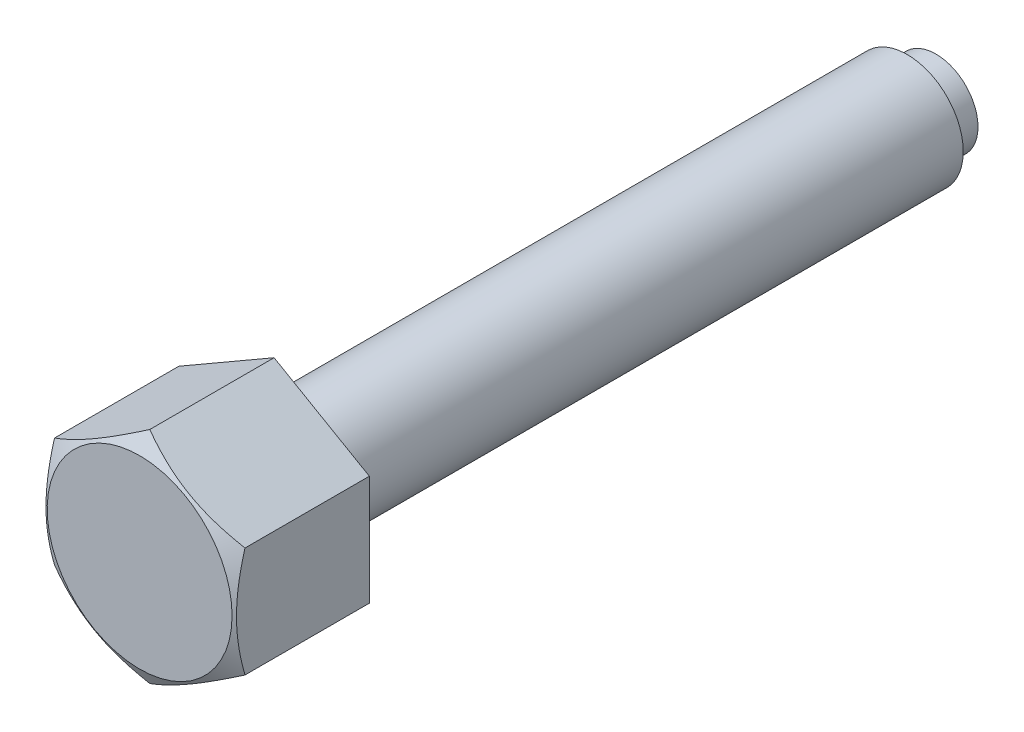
ISO-10303-21;
HEADER;
FILE_DESCRIPTION(('STEP AP214'),'2;1');
FILE_NAME('part.step','',(''),(''),'','','');
FILE_SCHEMA(('AUTOMOTIVE_DESIGN { 1 0 10303 214 1 1 1 1 }'));
ENDSEC;
DATA;
#1=APPLICATION_CONTEXT('core data for automotive mechanical design processes');
#2=APPLICATION_PROTOCOL_DEFINITION('international standard','automotive_design',2000,#1);
#3=PRODUCT_CONTEXT('',#1,'mechanical');
#4=PRODUCT('Part','Part','',(#3));
#5=PRODUCT_RELATED_PRODUCT_CATEGORY('part','',(#4));
#6=PRODUCT_DEFINITION_FORMATION('','',#4);
#7=PRODUCT_DEFINITION_CONTEXT('part definition',#1,'design');
#8=PRODUCT_DEFINITION('design','',#6,#7);
#9=PRODUCT_DEFINITION_SHAPE('','',#8);
#10=(LENGTH_UNIT() NAMED_UNIT(*) SI_UNIT(.MILLI.,.METRE.));
#11=(NAMED_UNIT(*) PLANE_ANGLE_UNIT() SI_UNIT($,.RADIAN.));
#12=(NAMED_UNIT(*) SI_UNIT($,.STERADIAN.) SOLID_ANGLE_UNIT());
#13=UNCERTAINTY_MEASURE_WITH_UNIT(LENGTH_MEASURE(1.E-05),#10,'distance_accuracy_value','');
#14=(GEOMETRIC_REPRESENTATION_CONTEXT(3) GLOBAL_UNCERTAINTY_ASSIGNED_CONTEXT((#13)) GLOBAL_UNIT_ASSIGNED_CONTEXT((#10,
#11,#12)) REPRESENTATION_CONTEXT('',''));
#15=CARTESIAN_POINT('',(0.,0.,0.));
#16=DIRECTION('',(0.,0.,1.));
#17=DIRECTION('',(1.,0.,0.));
#18=AXIS2_PLACEMENT_3D('',#15,#16,#17);
#19=CARTESIAN_POINT('',(0.,9.81495457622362,58.));
#20=DIRECTION('',(-0.5,-0.86602540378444,0.));
#21=DIRECTION('',(0.86602540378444,-0.5,0.));
#22=AXIS2_PLACEMENT_3D('',#19,#20,#21);
#23=PLANE('',#22);
#24=CARTESIAN_POINT('',(8.5002,4.90736181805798,71.0964063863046));
#25=CARTESIAN_POINT('',(8.31336077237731,5.01523349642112,71.1586762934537));
#26=CARTESIAN_POINT('',(8.12582494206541,5.1235073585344,71.2181201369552));
#27=CARTESIAN_POINT('',(7.74923024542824,5.34093440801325,71.3305773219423));
#28=CARTESIAN_POINT('',(7.56017075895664,5.45008795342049,71.3835878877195));
#29=CARTESIAN_POINT('',(6.98996524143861,5.77929626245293,71.5319290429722));
#30=CARTESIAN_POINT('',(6.60656835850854,6.00065055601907,71.6163035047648));
#31=CARTESIAN_POINT('',(6.03282233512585,6.33190297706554,71.7152424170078));
#32=CARTESIAN_POINT('',(5.84418723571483,6.44081150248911,71.7434272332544));
#33=CARTESIAN_POINT('',(5.4660639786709,6.65912106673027,71.7906883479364));
#34=CARTESIAN_POINT('',(5.27657589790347,6.76852206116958,71.8097654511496));
#35=CARTESIAN_POINT('',(4.89727347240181,6.98751241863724,71.8383276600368));
#36=CARTESIAN_POINT('',(4.70745974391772,7.09710142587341,71.8478236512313));
#37=CARTESIAN_POINT('',(4.32765694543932,7.31638067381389,71.8570200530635));
#38=CARTESIAN_POINT('',(4.13766788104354,7.42607091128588,71.8567207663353));
#39=CARTESIAN_POINT('',(3.78247698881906,7.63114046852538,71.8470079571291));
#40=CARTESIAN_POINT('',(3.6172500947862,7.72653426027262,71.838779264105));
#41=CARTESIAN_POINT('',(3.28718328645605,7.91709842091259,71.8150731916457));
#42=CARTESIAN_POINT('',(3.12234339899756,8.01226877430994,71.7995953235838));
#43=CARTESIAN_POINT('',(2.62846189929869,8.29741139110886,71.742653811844));
#44=CARTESIAN_POINT('',(2.30029449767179,8.48687892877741,71.690689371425));
#45=CARTESIAN_POINT('',(1.64047857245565,8.86782383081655,71.5607774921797));
#46=CARTESIAN_POINT('',(1.30891425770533,9.05925257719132,71.4822793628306));
#47=CARTESIAN_POINT('',(0.650730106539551,9.43925537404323,71.30412109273));
#48=CARTESIAN_POINT('',(0.324101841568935,9.62783429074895,71.2045027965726));
#49=CARTESIAN_POINT('',(-0.000199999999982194,9.81507004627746,71.0964063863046));
#50=B_SPLINE_CURVE_WITH_KNOTS('',3,(#24,#25,#26,#27,#28,#29,#30,#31,#32,#33,#34,#35,#36,#37,#38,
#39,#40,#41,#42,#43,#44,#45,#46,#47,#48,#49),.UNSPECIFIED.,.F.,.F.,(4,2,2,2,2,2,2,2,2,2,2,2,4),
(0.,0.673596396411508,1.34748239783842,2.69805431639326,3.35679995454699,4.01548737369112,
4.67342558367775,5.33134346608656,5.9040955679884,6.47688628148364,7.62328361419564,
8.79510569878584,9.96462743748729),.UNSPECIFIED.);
#51=CARTESIAN_POINT('',(8.5,4.90747728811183,71.0964730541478));
#52=VERTEX_POINT('',#51);
#53=CARTESIAN_POINT('',(0.,9.81495457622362,71.0964730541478));
#54=VERTEX_POINT('',#53);
#55=EDGE_CURVE('E30',#52,#54,#50,.T.);
#56=ORIENTED_EDGE('',*,*,#55,.F.);
#57=DIRECTION('',(0.,0.,1.));
#58=VECTOR('',#57,1.);
#59=CARTESIAN_POINT('',(8.5,4.90747728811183,58.));
#60=LINE('',#59,#58);
#61=CARTESIAN_POINT('',(8.5,4.90747728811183,60.));
#62=VERTEX_POINT('',#61);
#63=EDGE_CURVE('E97',#62,#52,#60,.T.);
#64=ORIENTED_EDGE('',*,*,#63,.F.);
#65=DIRECTION('',(0.86602540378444,-0.5,0.));
#66=VECTOR('',#65,1.);
#67=CARTESIAN_POINT('',(8.,5.19615242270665,60.));
#68=LINE('',#67,#66);
#69=CARTESIAN_POINT('',(0.,9.81495457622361,60.));
#70=VERTEX_POINT('',#69);
#71=EDGE_CURVE('E111',#70,#62,#68,.T.);
#72=ORIENTED_EDGE('',*,*,#71,.F.);
#73=DIRECTION('',(0.,0.,1.));
#74=VECTOR('',#73,1.);
#75=CARTESIAN_POINT('',(0.,9.81495457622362,58.));
#76=LINE('',#75,#74);
#77=EDGE_CURVE('E37',#70,#54,#76,.T.);
#78=ORIENTED_EDGE('',*,*,#77,.T.);
#79=EDGE_LOOP('',(#56,#64,#72,#78));
#80=FACE_BOUND('',#79,.T.);
#81=ADVANCED_FACE('F15',(#80),#23,.F.);
#82=CARTESIAN_POINT('',(8.5,4.90747728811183,58.));
#83=DIRECTION('',(-1.,0.,0.));
#84=DIRECTION('',(0.,0.,1.));
#85=AXIS2_PLACEMENT_3D('',#82,#83,#84);
#86=PLANE('',#85);
#87=CARTESIAN_POINT('',(8.5,-13.1444852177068,67.7256715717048));
#88=CARTESIAN_POINT('',(8.5,-12.7735482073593,67.9054577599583));
#89=CARTESIAN_POINT('',(8.5,-12.4017556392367,68.0835091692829));
#90=CARTESIAN_POINT('',(8.5,-11.6560042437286,68.4351659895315));
#91=CARTESIAN_POINT('',(8.5,-11.2820450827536,68.60877069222));
#92=CARTESIAN_POINT('',(8.5,-10.5295605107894,68.9514391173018));
#93=CARTESIAN_POINT('',(8.5,-10.1510212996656,69.1204726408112));
#94=CARTESIAN_POINT('',(8.5,-9.39091897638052,69.451571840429));
#95=CARTESIAN_POINT('',(8.5,-9.00935600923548,69.6136378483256));
#96=CARTESIAN_POINT('',(8.5,-8.23042824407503,69.9339663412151));
#97=CARTESIAN_POINT('',(8.5,-7.83294612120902,70.0919451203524));
#98=CARTESIAN_POINT('',(8.5,-7.0333186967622,70.3958549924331));
#99=CARTESIAN_POINT('',(8.5,-6.63117287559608,70.5417847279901));
#100=CARTESIAN_POINT('',(8.5,-5.82233833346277,70.8177375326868));
#101=CARTESIAN_POINT('',(8.5,-5.41566083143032,70.9477931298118));
#102=CARTESIAN_POINT('',(8.5,-4.59648722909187,71.1878013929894));
#103=CARTESIAN_POINT('',(8.5,-4.18399301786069,71.2977604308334));
#104=CARTESIAN_POINT('',(8.5,-3.35516554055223,71.4916836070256));
#105=CARTESIAN_POINT('',(8.5,-2.93886583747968,71.575787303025));
#106=CARTESIAN_POINT('',(8.5,-2.31065557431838,71.6788915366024));
#107=CARTESIAN_POINT('',(8.5,-2.10060965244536,71.709419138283));
#108=CARTESIAN_POINT('',(8.5,-1.67948660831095,71.7621909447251));
#109=CARTESIAN_POINT('',(8.5,-1.46840958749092,71.7844359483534));
#110=CARTESIAN_POINT('',(8.5,-1.04824802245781,71.8199223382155));
#111=CARTESIAN_POINT('',(8.5,-0.83917304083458,71.8332765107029));
#112=CARTESIAN_POINT('',(8.5,-0.420645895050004,71.8511341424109));
#113=CARTESIAN_POINT('',(8.5,-0.211193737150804,71.8556377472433));
#114=CARTESIAN_POINT('',(8.5,0.207713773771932,71.8556869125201));
#115=CARTESIAN_POINT('',(8.5,0.417169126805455,71.8512324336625));
#116=CARTESIAN_POINT('',(8.5,0.835707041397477,71.8334736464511));
#117=CARTESIAN_POINT('',(8.5,1.04478958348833,71.8201688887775));
#118=CARTESIAN_POINT('',(8.5,1.54842530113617,71.7777413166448));
#119=CARTESIAN_POINT('',(8.5,1.84262681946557,71.7443556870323));
#120=CARTESIAN_POINT('',(8.5,2.42880766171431,71.6618915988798));
#121=CARTESIAN_POINT('',(8.5,2.7207866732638,71.6128109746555));
#122=CARTESIAN_POINT('',(8.5,3.59307794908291,71.4446324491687));
#123=CARTESIAN_POINT('',(8.5,4.16941089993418,71.3046296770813));
#124=CARTESIAN_POINT('',(8.5,5.03112954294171,71.0623378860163));
#125=CARTESIAN_POINT('',(8.5,5.3209971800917,70.9750764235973));
#126=CARTESIAN_POINT('',(8.5,5.8979162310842,70.7916109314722));
#127=CARTESIAN_POINT('',(8.5,6.18496762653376,70.6954068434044));
#128=CARTESIAN_POINT('',(8.5,6.75634679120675,70.4955896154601));
#129=CARTESIAN_POINT('',(8.5,7.04067545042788,70.3919789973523));
#130=CARTESIAN_POINT('',(8.5,7.6069852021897,70.1785557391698));
#131=CARTESIAN_POINT('',(8.5,7.88896632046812,70.0687431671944));
#132=CARTESIAN_POINT('',(8.5,8.54720008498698,69.8053973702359));
#133=CARTESIAN_POINT('',(8.5,8.92261940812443,69.6497852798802));
#134=CARTESIAN_POINT('',(8.5,9.67032637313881,69.3311898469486));
#135=CARTESIAN_POINT('',(8.5,10.0426138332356,69.168206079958));
#136=CARTESIAN_POINT('',(8.5,10.7846309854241,68.8363238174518));
#137=CARTESIAN_POINT('',(8.5,11.1543601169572,68.667424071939));
#138=CARTESIAN_POINT('',(8.5,11.8916026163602,68.3248863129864));
#139=CARTESIAN_POINT('',(8.5,12.2591160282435,68.1512483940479));
#140=CARTESIAN_POINT('',(8.5,12.9926756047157,67.7999257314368));
#141=CARTESIAN_POINT('',(8.5,13.3587198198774,67.6222369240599));
#142=CARTESIAN_POINT('',(8.5,14.0892432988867,67.2636680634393));
#143=CARTESIAN_POINT('',(8.5,14.4537225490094,67.0827879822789));
#144=CARTESIAN_POINT('',(8.5,15.5450894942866,66.5362453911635));
#145=CARTESIAN_POINT('',(8.5,16.2700001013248,66.1666352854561));
#146=CARTESIAN_POINT('',(8.5,17.6565146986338,65.4506840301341));
#147=CARTESIAN_POINT('',(8.5,18.3184225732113,65.1049287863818));
#148=CARTESIAN_POINT('',(8.5,19.6397705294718,64.4086843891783));
#149=CARTESIAN_POINT('',(8.5,20.2992105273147,64.0581950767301));
#150=CARTESIAN_POINT('',(8.5,21.6145701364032,63.3544543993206));
#151=CARTESIAN_POINT('',(8.5,22.2704944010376,63.0012117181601));
#152=CARTESIAN_POINT('',(8.5,23.5807608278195,62.2918862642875));
#153=CARTESIAN_POINT('',(8.5,24.2351030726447,61.9358036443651));
#154=CARTESIAN_POINT('',(8.5,24.8888609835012,61.5786585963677));
#155=B_SPLINE_CURVE_WITH_KNOTS('',3,(#87,#88,#89,#90,#91,#92,#93,#94,#95,#96,#97,#98,#99,#100,
#101,#102,#103,#104,#105,#106,#107,#108,#109,#110,#111,#112,#113,#114,#115,#116,#117,#118,#119,
#120,#121,#122,#123,#124,#125,#126,#127,#128,#129,#130,#131,#132,#133,#134,#135,#136,#137,#138,
#139,#140,#141,#142,#143,#144,#145,#146,#147,#148,#149,#150,#151,#152,#153,#154),.UNSPECIFIED.,
.F.,.F.,(4,2,2,2,2,2,2,2,2,2,2,2,2,2,2,2,2,2,2,2,2,2,2,2,2,2,2,2,2,2,2,2,2,4),(0.,
1.23664620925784,2.47348817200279,3.71712738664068,4.96070731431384,6.24373307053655,
7.52690316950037,8.80739811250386,10.0874863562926,11.3605386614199,11.9971592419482,
12.633718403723,13.262040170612,13.8903516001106,14.5186657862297,15.1470118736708,
16.0347786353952,16.9226679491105,18.6994472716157,19.6075251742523,20.5156090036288,
21.4233851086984,22.3311512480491,23.5502231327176,24.769365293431,25.9887666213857,
27.208143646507,28.4288029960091,29.649473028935,32.0905009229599,34.3307970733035,
36.571168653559,38.8061451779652,41.0410022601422),.UNSPECIFIED.);
#156=CARTESIAN_POINT('',(8.5,-4.90747728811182,71.0964730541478));
#157=VERTEX_POINT('',#156);
#158=EDGE_CURVE('E157',#157,#52,#155,.T.);
#159=ORIENTED_EDGE('',*,*,#158,.F.);
#160=DIRECTION('',(0.,0.,1.));
#161=VECTOR('',#160,1.);
#162=CARTESIAN_POINT('',(8.5,-4.90747728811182,58.));
#163=LINE('',#162,#161);
#164=CARTESIAN_POINT('',(8.5,-4.90747728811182,60.));
#165=VERTEX_POINT('',#164);
#166=EDGE_CURVE('E94',#165,#157,#163,.T.);
#167=ORIENTED_EDGE('',*,*,#166,.F.);
#168=DIRECTION('',(0.,-1.,0.));
#169=VECTOR('',#168,1.);
#170=CARTESIAN_POINT('',(8.5,0.,60.));
#171=LINE('',#170,#169);
#172=EDGE_CURVE('E108',#62,#165,#171,.T.);
#173=ORIENTED_EDGE('',*,*,#172,.F.);
#174=ORIENTED_EDGE('',*,*,#63,.T.);
#175=EDGE_LOOP('',(#159,#167,#173,#174));
#176=FACE_BOUND('',#175,.T.);
#177=ADVANCED_FACE('F137',(#176),#86,.F.);
#178=CARTESIAN_POINT('',(0.,-9.81495457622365,58.));
#179=DIRECTION('',(0.5,-0.866025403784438,0.));
#180=DIRECTION('',(0.866025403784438,0.5,0.));
#181=AXIS2_PLACEMENT_3D('',#178,#179,#180);
#182=PLANE('',#181);
#183=ORIENTED_EDGE('',*,*,#166,.T.);
#184=CARTESIAN_POINT('',(8.5002,-4.90736181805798,71.0964063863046));
#185=CARTESIAN_POINT('',(8.31336077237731,-5.01523349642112,71.1586762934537));
#186=CARTESIAN_POINT('',(8.1258249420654,-5.1235073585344,71.2181201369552));
#187=CARTESIAN_POINT('',(7.74923024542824,-5.34093440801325,71.3305773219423));
#188=CARTESIAN_POINT('',(7.56017075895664,-5.45008795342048,71.3835878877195));
#189=CARTESIAN_POINT('',(6.98996524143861,-5.77929626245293,71.5319290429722));
#190=CARTESIAN_POINT('',(6.60656835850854,-6.00065055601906,71.6163035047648));
#191=CARTESIAN_POINT('',(6.03282233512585,-6.33190297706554,71.7152424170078));
#192=CARTESIAN_POINT('',(5.84418723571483,-6.4408115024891,71.7434272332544));
#193=CARTESIAN_POINT('',(5.4660639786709,-6.65912106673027,71.7906883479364));
#194=CARTESIAN_POINT('',(5.27657589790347,-6.76852206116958,71.8097654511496));
#195=CARTESIAN_POINT('',(4.89727347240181,-6.98751241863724,71.8383276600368));
#196=CARTESIAN_POINT('',(4.70745974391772,-7.09710142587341,71.8478236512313));
#197=CARTESIAN_POINT('',(4.32765694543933,-7.31638067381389,71.8570200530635));
#198=CARTESIAN_POINT('',(4.13766788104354,-7.42607091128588,71.8567207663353));
#199=CARTESIAN_POINT('',(3.78247698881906,-7.63114046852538,71.8470079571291));
#200=CARTESIAN_POINT('',(3.6172500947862,-7.72653426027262,71.838779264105));
#201=CARTESIAN_POINT('',(3.28718328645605,-7.9170984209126,71.8150731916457));
#202=CARTESIAN_POINT('',(3.12234339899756,-8.01226877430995,71.7995953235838));
#203=CARTESIAN_POINT('',(2.62846189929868,-8.29741139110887,71.7426538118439));
#204=CARTESIAN_POINT('',(2.30029449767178,-8.48687892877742,71.690689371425));
#205=CARTESIAN_POINT('',(1.64047857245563,-8.86782383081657,71.5607774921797));
#206=CARTESIAN_POINT('',(1.30891425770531,-9.05925257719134,71.4822793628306));
#207=CARTESIAN_POINT('',(0.650730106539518,-9.43925537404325,71.30412109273));
#208=CARTESIAN_POINT('',(0.324101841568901,-9.62783429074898,71.2045027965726));
#209=CARTESIAN_POINT('',(-0.000200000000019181,-9.81507004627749,71.0964063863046));
#210=B_SPLINE_CURVE_WITH_KNOTS('',3,(#184,#185,#186,#187,#188,#189,#190,#191,#192,#193,#194,
#195,#196,#197,#198,#199,#200,#201,#202,#203,#204,#205,#206,#207,#208,#209),.UNSPECIFIED.,.F.,
.F.,(4,2,2,2,2,2,2,2,2,2,2,2,4),(0.,0.673596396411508,1.34748239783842,2.69805431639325,
3.35679995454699,4.01548737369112,4.67342558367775,5.33134346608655,5.9040955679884,
6.47688628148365,7.62328361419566,8.79510569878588,9.96462743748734),.UNSPECIFIED.);
#211=CARTESIAN_POINT('',(0.,-9.81495457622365,71.0964730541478));
#212=VERTEX_POINT('',#211);
#213=EDGE_CURVE('E163',#157,#212,#210,.T.);
#214=ORIENTED_EDGE('',*,*,#213,.T.);
#215=DIRECTION('',(0.,0.,1.));
#216=VECTOR('',#215,1.);
#217=CARTESIAN_POINT('',(0.,-9.81495457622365,58.));
#218=LINE('',#217,#216);
#219=CARTESIAN_POINT('',(0.,-9.81495457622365,60.));
#220=VERTEX_POINT('',#219);
#221=EDGE_CURVE('E87',#220,#212,#218,.T.);
#222=ORIENTED_EDGE('',*,*,#221,.F.);
#223=DIRECTION('',(0.866025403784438,0.5,0.));
#224=VECTOR('',#223,1.);
#225=CARTESIAN_POINT('',(8.,-5.19615242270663,60.));
#226=LINE('',#225,#224);
#227=EDGE_CURVE('E106',#220,#165,#226,.T.);
#228=ORIENTED_EDGE('',*,*,#227,.T.);
#229=EDGE_LOOP('',(#183,#214,#222,#228));
#230=FACE_BOUND('',#229,.T.);
#231=ADVANCED_FACE('F143',(#230),#182,.T.);
#232=CARTESIAN_POINT('',(0.,-9.81495457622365,58.));
#233=DIRECTION('',(0.5,0.866025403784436,0.));
#234=DIRECTION('',(-0.866025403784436,0.5,0.));
#235=AXIS2_PLACEMENT_3D('',#232,#233,#234);
#236=PLANE('',#235);
#237=CARTESIAN_POINT('',(-8.5002,-4.90736181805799,71.0964063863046));
#238=CARTESIAN_POINT('',(-8.31336077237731,-5.01523349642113,71.1586762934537));
#239=CARTESIAN_POINT('',(-8.12582494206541,-5.12350735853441,71.2181201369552));
#240=CARTESIAN_POINT('',(-7.74923024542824,-5.34093440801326,71.3305773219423));
#241=CARTESIAN_POINT('',(-7.56017075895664,-5.45008795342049,71.3835878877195));
#242=CARTESIAN_POINT('',(-6.98996524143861,-5.77929626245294,71.5319290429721));
#243=CARTESIAN_POINT('',(-6.60656835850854,-6.00065055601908,71.6163035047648));
#244=CARTESIAN_POINT('',(-6.03282233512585,-6.33190297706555,71.7152424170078));
#245=CARTESIAN_POINT('',(-5.84418723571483,-6.44081150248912,71.7434272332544));
#246=CARTESIAN_POINT('',(-5.4660639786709,-6.65912106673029,71.7906883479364));
#247=CARTESIAN_POINT('',(-5.27657589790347,-6.76852206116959,71.8097654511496));
#248=CARTESIAN_POINT('',(-4.89727347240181,-6.98751241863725,71.8383276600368));
#249=CARTESIAN_POINT('',(-4.70745974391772,-7.09710142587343,71.8478236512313));
#250=CARTESIAN_POINT('',(-4.32765694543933,-7.3163806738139,71.8570200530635));
#251=CARTESIAN_POINT('',(-4.13766788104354,-7.4260709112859,71.8567207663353));
#252=CARTESIAN_POINT('',(-3.78247698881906,-7.6311404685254,71.8470079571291));
#253=CARTESIAN_POINT('',(-3.61725009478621,-7.72653426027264,71.838779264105));
#254=CARTESIAN_POINT('',(-3.28718328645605,-7.91709842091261,71.8150731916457));
#255=CARTESIAN_POINT('',(-3.12234339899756,-8.01226877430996,71.7995953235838));
#256=CARTESIAN_POINT('',(-2.6284618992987,-8.29741139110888,71.7426538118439));
#257=CARTESIAN_POINT('',(-2.3002944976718,-8.48687892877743,71.690689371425));
#258=CARTESIAN_POINT('',(-1.64047857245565,-8.86782383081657,71.5607774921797));
#259=CARTESIAN_POINT('',(-1.30891425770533,-9.05925257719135,71.4822793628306));
#260=CARTESIAN_POINT('',(-0.650730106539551,-9.43925537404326,71.30412109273));
#261=CARTESIAN_POINT('',(-0.324101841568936,-9.62783429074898,71.2045027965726));
#262=CARTESIAN_POINT('',(0.000199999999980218,-9.81507004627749,71.0964063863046));
#263=B_SPLINE_CURVE_WITH_KNOTS('',3,(#237,#238,#239,#240,#241,#242,#243,#244,#245,#246,#247,
#248,#249,#250,#251,#252,#253,#254,#255,#256,#257,#258,#259,#260,#261,#262),.UNSPECIFIED.,.F.,
.F.,(4,2,2,2,2,2,2,2,2,2,2,2,4),(0.,0.673596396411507,1.34748239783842,2.69805431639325,
3.35679995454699,4.01548737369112,4.67342558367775,5.33134346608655,5.90409556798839,
6.47688628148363,7.62328361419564,8.79510569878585,9.96462743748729),.UNSPECIFIED.);
#264=CARTESIAN_POINT('',(-8.5,-4.90747728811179,71.0964730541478));
#265=VERTEX_POINT('',#264);
#266=EDGE_CURVE('E81',#265,#212,#263,.T.);
#267=ORIENTED_EDGE('',*,*,#266,.F.);
#268=DIRECTION('',(0.,0.,1.));
#269=VECTOR('',#268,1.);
#270=CARTESIAN_POINT('',(-8.5,-4.90747728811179,58.));
#271=LINE('',#270,#269);
#272=CARTESIAN_POINT('',(-8.5,-4.90747728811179,60.));
#273=VERTEX_POINT('',#272);
#274=EDGE_CURVE('E80',#273,#265,#271,.T.);
#275=ORIENTED_EDGE('',*,*,#274,.F.);
#276=DIRECTION('',(-0.866025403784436,0.5,0.));
#277=VECTOR('',#276,1.);
#278=CARTESIAN_POINT('',(-0.500000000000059,-9.52627944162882,60.));
#279=LINE('',#278,#277);
#280=EDGE_CURVE('E103',#220,#273,#279,.T.);
#281=ORIENTED_EDGE('',*,*,#280,.F.);
#282=ORIENTED_EDGE('',*,*,#221,.T.);
#283=EDGE_LOOP('',(#267,#275,#281,#282));
#284=FACE_BOUND('',#283,.T.);
#285=ADVANCED_FACE('F239',(#284),#236,.F.);
#286=CARTESIAN_POINT('',(-8.5,4.90747728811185,58.));
#287=DIRECTION('',(-1.,0.,0.));
#288=DIRECTION('',(0.,-1.,0.));
#289=AXIS2_PLACEMENT_3D('',#286,#287,#288);
#290=PLANE('',#289);
#291=ORIENTED_EDGE('',*,*,#274,.T.);
#292=CARTESIAN_POINT('',(-8.5,-13.1444852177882,67.7256715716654));
#293=CARTESIAN_POINT('',(-8.5,-12.773548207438,67.9054577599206));
#294=CARTESIAN_POINT('',(-8.5,-12.4017556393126,68.0835091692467));
#295=CARTESIAN_POINT('',(-8.5,-11.656004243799,68.4351659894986));
#296=CARTESIAN_POINT('',(-8.5,-11.2820450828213,68.6087706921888));
#297=CARTESIAN_POINT('',(-8.5,-10.5295605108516,68.9514391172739));
#298=CARTESIAN_POINT('',(-8.5,-10.1510212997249,69.120472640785));
#299=CARTESIAN_POINT('',(-8.5,-9.3909189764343,69.451571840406));
#300=CARTESIAN_POINT('',(-8.5,-9.00935600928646,69.6136378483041));
#301=CARTESIAN_POINT('',(-8.5,-8.23042824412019,69.9339663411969));
#302=CARTESIAN_POINT('',(-8.5,-7.83294612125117,70.091945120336));
#303=CARTESIAN_POINT('',(-8.5,-7.03331869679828,70.3958549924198));
#304=CARTESIAN_POINT('',(-8.5,-6.63117287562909,70.5417847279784));
#305=CARTESIAN_POINT('',(-8.5,-5.82233833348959,70.8177375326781));
#306=CARTESIAN_POINT('',(-8.5,-5.41566083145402,70.9477931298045));
#307=CARTESIAN_POINT('',(-8.5,-4.59648722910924,71.1878013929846));
#308=CARTESIAN_POINT('',(-8.5,-4.18399301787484,71.2977604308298));
#309=CARTESIAN_POINT('',(-8.5,-3.35516554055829,71.4916836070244));
#310=CARTESIAN_POINT('',(-8.5,-2.93886583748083,71.5757873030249));
#311=CARTESIAN_POINT('',(-8.5,-2.31065557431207,71.6788915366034));
#312=CARTESIAN_POINT('',(-8.5,-2.10060965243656,71.7094191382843));
#313=CARTESIAN_POINT('',(-8.5,-1.67948660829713,71.7621909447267));
#314=CARTESIAN_POINT('',(-8.5,-1.46840958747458,71.784435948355));
#315=CARTESIAN_POINT('',(-8.5,-1.04824802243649,71.819922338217));
#316=CARTESIAN_POINT('',(-8.5,-0.839173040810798,71.8332765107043));
#317=CARTESIAN_POINT('',(-8.5,-0.4206458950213,71.8511341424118));
#318=CARTESIAN_POINT('',(-8.5,-0.211193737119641,71.8556377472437));
#319=CARTESIAN_POINT('',(-8.5,0.207713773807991,71.8556869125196));
#320=CARTESIAN_POINT('',(-8.5,0.417169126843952,71.8512324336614));
#321=CARTESIAN_POINT('',(-8.5,0.835707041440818,71.8334736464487));
#322=CARTESIAN_POINT('',(-8.5,1.04478958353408,71.8201688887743));
#323=CARTESIAN_POINT('',(-8.5,1.5484253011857,71.7777413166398));
#324=CARTESIAN_POINT('',(-8.5,1.84262681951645,71.7443556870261));
#325=CARTESIAN_POINT('',(-8.5,2.42880766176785,71.6618915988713));
#326=CARTESIAN_POINT('',(-8.5,2.72078667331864,71.6128109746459));
#327=CARTESIAN_POINT('',(-8.5,3.5930779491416,71.4446324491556));
#328=CARTESIAN_POINT('',(-8.5,4.16941089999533,71.3046296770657));
#329=CARTESIAN_POINT('',(-8.5,5.03112954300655,71.0623378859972));
#330=CARTESIAN_POINT('',(-8.5,5.3209971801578,70.975076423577));
#331=CARTESIAN_POINT('',(-8.5,5.89791623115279,70.7916109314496));
#332=CARTESIAN_POINT('',(-8.5,6.18496762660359,70.6954068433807));
#333=CARTESIAN_POINT('',(-8.5,6.75634679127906,70.4955896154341));
#334=CARTESIAN_POINT('',(-8.5,7.04067545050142,70.3919789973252));
#335=CARTESIAN_POINT('',(-8.5,7.60698520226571,70.1785557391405));
#336=CARTESIAN_POINT('',(-8.5,7.88896632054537,70.0687431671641));
#337=CARTESIAN_POINT('',(-8.5,8.54720008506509,69.8053973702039));
#338=CARTESIAN_POINT('',(-8.5,8.9226194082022,69.6497852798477));
#339=CARTESIAN_POINT('',(-8.5,9.67032637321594,69.3311898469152));
#340=CARTESIAN_POINT('',(-8.5,10.0426138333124,69.1682060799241));
#341=CARTESIAN_POINT('',(-8.5,10.7846309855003,68.8363238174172));
#342=CARTESIAN_POINT('',(-8.5,11.1543601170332,68.6674240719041));
#343=CARTESIAN_POINT('',(-8.5,11.8916026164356,68.3248863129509));
#344=CARTESIAN_POINT('',(-8.5,12.2591160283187,68.1512483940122));
#345=CARTESIAN_POINT('',(-8.5,12.9926756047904,67.7999257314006));
#346=CARTESIAN_POINT('',(-8.5,13.3587198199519,67.6222369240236));
#347=CARTESIAN_POINT('',(-8.5,14.0892432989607,67.2636680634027));
#348=CARTESIAN_POINT('',(-8.5,14.4537225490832,67.0827879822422));
#349=CARTESIAN_POINT('',(-8.5,15.5450894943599,66.5362453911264));
#350=CARTESIAN_POINT('',(-8.5,16.2700001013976,66.1666352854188));
#351=CARTESIAN_POINT('',(-8.5,17.6565146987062,65.4506840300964));
#352=CARTESIAN_POINT('',(-8.5,18.3184225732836,65.1049287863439));
#353=CARTESIAN_POINT('',(-8.5,19.639770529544,64.40868438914));
#354=CARTESIAN_POINT('',(-8.5,20.2992105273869,64.0581950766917));
#355=CARTESIAN_POINT('',(-8.5,21.6145701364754,63.3544543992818));
#356=CARTESIAN_POINT('',(-8.5,22.2704944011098,63.0012117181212));
#357=CARTESIAN_POINT('',(-8.5,23.5807608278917,62.2918862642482));
#358=CARTESIAN_POINT('',(-8.5,24.2351030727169,61.9358036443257));
#359=CARTESIAN_POINT('',(-8.5,24.8888609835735,61.5786585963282));
#360=B_SPLINE_CURVE_WITH_KNOTS('',3,(#292,#293,#294,#295,#296,#297,#298,#299,#300,#301,#302,
#303,#304,#305,#306,#307,#308,#309,#310,#311,#312,#313,#314,#315,#316,#317,#318,#319,#320,#321,
#322,#323,#324,#325,#326,#327,#328,#329,#330,#331,#332,#333,#334,#335,#336,#337,#338,#339,#340,
#341,#342,#343,#344,#345,#346,#347,#348,#349,#350,#351,#352,#353,#354,#355,#356,#357,#358,#359),
.UNSPECIFIED.,.F.,.F.,(4,2,2,2,2,2,2,2,2,2,2,2,2,2,2,2,2,2,2,2,2,2,2,2,2,2,2,2,2,2,2,2,2,4),(0.,
1.23664620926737,2.47348817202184,3.71712738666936,4.96070731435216,6.24373307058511,
7.52690316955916,8.80739811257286,10.0874863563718,11.3605386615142,11.99715924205,
12.6337184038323,13.2620401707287,13.8903516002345,14.5186657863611,15.1470118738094,
16.0347786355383,16.9226679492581,18.6994472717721,19.6075251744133,20.5156090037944,
21.4233851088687,22.331151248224,23.5502231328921,24.7693652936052,25.9887666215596,
27.2081436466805,28.4288029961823,29.6494730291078,32.0905009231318,34.3307970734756,
36.5711686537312,38.8061451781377,41.041002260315),.UNSPECIFIED.);
#361=CARTESIAN_POINT('',(-8.5,4.90747728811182,71.0964730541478));
#362=VERTEX_POINT('',#361);
#363=EDGE_CURVE('E68',#265,#362,#360,.T.);
#364=ORIENTED_EDGE('',*,*,#363,.T.);
#365=DIRECTION('',(0.,0.,1.));
#366=VECTOR('',#365,1.);
#367=CARTESIAN_POINT('',(-8.5,4.90747728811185,58.));
#368=LINE('',#367,#366);
#369=CARTESIAN_POINT('',(-8.5,4.90747728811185,60.));
#370=VERTEX_POINT('',#369);
#371=EDGE_CURVE('E77',#370,#362,#368,.T.);
#372=ORIENTED_EDGE('',*,*,#371,.F.);
#373=DIRECTION('',(0.,-1.,0.));
#374=VECTOR('',#373,1.);
#375=CARTESIAN_POINT('',(-8.5,0.,60.));
#376=LINE('',#375,#374);
#377=EDGE_CURVE('E101',#370,#273,#376,.T.);
#378=ORIENTED_EDGE('',*,*,#377,.T.);
#379=EDGE_LOOP('',(#291,#364,#372,#378));
#380=FACE_BOUND('',#379,.T.);
#381=ADVANCED_FACE('F76',(#380),#290,.T.);
#382=CARTESIAN_POINT('',(0.,9.81495457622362,58.));
#383=DIRECTION('',(-0.5,0.866025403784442,0.));
#384=DIRECTION('',(-0.866025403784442,-0.5,0.));
#385=AXIS2_PLACEMENT_3D('',#382,#383,#384);
#386=PLANE('',#385);
#387=ORIENTED_EDGE('',*,*,#371,.T.);
#388=CARTESIAN_POINT('',(-8.5002,4.90736181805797,71.0964063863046));
#389=CARTESIAN_POINT('',(-8.31336077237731,5.01523349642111,71.1586762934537));
#390=CARTESIAN_POINT('',(-8.12582494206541,5.12350735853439,71.2181201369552));
#391=CARTESIAN_POINT('',(-7.74923024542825,5.34093440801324,71.3305773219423));
#392=CARTESIAN_POINT('',(-7.56017075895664,5.45008795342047,71.3835878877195));
#393=CARTESIAN_POINT('',(-6.9899652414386,5.77929626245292,71.5319290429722));
#394=CARTESIAN_POINT('',(-6.60656835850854,6.00065055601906,71.6163035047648));
#395=CARTESIAN_POINT('',(-6.03282233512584,6.33190297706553,71.7152424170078));
#396=CARTESIAN_POINT('',(-5.84418723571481,6.4408115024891,71.7434272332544));
#397=CARTESIAN_POINT('',(-5.46606397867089,6.65912106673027,71.7906883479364));
#398=CARTESIAN_POINT('',(-5.27657589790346,6.76852206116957,71.8097654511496));
#399=CARTESIAN_POINT('',(-4.8972734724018,6.98751241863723,71.8383276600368));
#400=CARTESIAN_POINT('',(-4.70745974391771,7.0971014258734,71.8478236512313));
#401=CARTESIAN_POINT('',(-4.32765694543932,7.31638067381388,71.8570200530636));
#402=CARTESIAN_POINT('',(-4.13766788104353,7.42607091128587,71.8567207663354));
#403=CARTESIAN_POINT('',(-3.78247698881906,7.63114046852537,71.8470079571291));
#404=CARTESIAN_POINT('',(-3.61725009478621,7.7265342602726,71.838779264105));
#405=CARTESIAN_POINT('',(-3.28718328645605,7.91709842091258,71.8150731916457));
#406=CARTESIAN_POINT('',(-3.12234339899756,8.01226877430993,71.7995953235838));
#407=CARTESIAN_POINT('',(-2.62846189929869,8.29741139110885,71.742653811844));
#408=CARTESIAN_POINT('',(-2.30029449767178,8.4868789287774,71.690689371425));
#409=CARTESIAN_POINT('',(-1.64047857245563,8.86782383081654,71.5607774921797));
#410=CARTESIAN_POINT('',(-1.3089142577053,9.05925257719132,71.4822793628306));
#411=CARTESIAN_POINT('',(-0.650730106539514,9.43925537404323,71.30412109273));
#412=CARTESIAN_POINT('',(-0.324101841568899,9.62783429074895,71.2045027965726));
#413=CARTESIAN_POINT('',(0.000200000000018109,9.81507004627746,71.0964063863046));
#414=B_SPLINE_CURVE_WITH_KNOTS('',3,(#388,#389,#390,#391,#392,#393,#394,#395,#396,#397,#398,
#399,#400,#401,#402,#403,#404,#405,#406,#407,#408,#409,#410,#411,#412,#413),.UNSPECIFIED.,.F.,
.F.,(4,2,2,2,2,2,2,2,2,2,2,2,4),(0.,0.673596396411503,1.34748239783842,2.69805431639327,
3.35679995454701,4.01548737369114,4.67342558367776,5.33134346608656,5.90409556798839,
6.47688628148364,7.62328361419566,8.79510569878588,9.96462743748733),.UNSPECIFIED.);
#415=EDGE_CURVE('E65',#362,#54,#414,.T.);
#416=ORIENTED_EDGE('',*,*,#415,.T.);
#417=ORIENTED_EDGE('',*,*,#77,.F.);
#418=DIRECTION('',(-0.866025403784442,-0.5,0.));
#419=VECTOR('',#418,1.);
#420=CARTESIAN_POINT('',(-0.499999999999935,9.52627944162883,60.));
#421=LINE('',#420,#419);
#422=EDGE_CURVE('E85',#70,#370,#421,.T.);
#423=ORIENTED_EDGE('',*,*,#422,.T.);
#424=EDGE_LOOP('',(#387,#416,#417,#423));
#425=FACE_BOUND('',#424,.T.);
#426=ADVANCED_FACE('F83',(#425),#386,.T.);
#427=CARTESIAN_POINT('',(0.,0.,8.));
#428=DIRECTION('',(0.,0.,1.));
#429=DIRECTION('',(1.,0.,0.));
#430=AXIS2_PLACEMENT_3D('',#427,#428,#429);
#431=SPHERICAL_SURFACE('',#430,8.);
#432=CARTESIAN_POINT('',(0.,0.,0.933352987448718));
#433=DIRECTION('',(0.,0.,1.));
#434=DIRECTION('',(1.,0.,0.));
#435=AXIS2_PLACEMENT_3D('',#432,#433,#434);
#436=CIRCLE('',#435,3.75);
#437=CARTESIAN_POINT('',(3.75,0.,0.933352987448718));
#438=VERTEX_POINT('',#437);
#439=EDGE_CURVE('E9',#438,#438,#436,.T.);
#440=ORIENTED_EDGE('',*,*,#439,.F.);
#441=EDGE_LOOP('',(#440));
#442=FACE_BOUND('',#441,.T.);
#443=ADVANCED_FACE('F17',(#442),#431,.T.);
#444=CARTESIAN_POINT('',(0.,0.,110.));
#445=DIRECTION('',(0.,0.,1.));
#446=DIRECTION('',(1.,0.,0.));
#447=AXIS2_PLACEMENT_3D('',#444,#445,#446);
#448=CYLINDRICAL_SURFACE('',#447,3.75);
#449=ORIENTED_EDGE('',*,*,#439,.T.);
#450=EDGE_LOOP('',(#449));
#451=FACE_BOUND('',#450,.T.);
#452=CARTESIAN_POINT('',(0.,0.,3.5));
#453=DIRECTION('',(0.,0.,1.));
#454=DIRECTION('',(1.,0.,0.));
#455=AXIS2_PLACEMENT_3D('',#452,#453,#454);
#456=CIRCLE('',#455,3.75);
#457=CARTESIAN_POINT('',(3.75,0.,3.5));
#458=VERTEX_POINT('',#457);
#459=EDGE_CURVE('E23',#458,#458,#456,.T.);
#460=ORIENTED_EDGE('',*,*,#459,.F.);
#461=EDGE_LOOP('',(#460));
#462=FACE_BOUND('',#461,.T.);
#463=ADVANCED_FACE('F124',(#451,#462),#448,.T.);
#464=CARTESIAN_POINT('',(3.75,0.,3.5));
#465=DIRECTION('',(0.,0.,1.));
#466=DIRECTION('',(1.,0.,0.));
#467=AXIS2_PLACEMENT_3D('',#464,#465,#466);
#468=PLANE('',#467);
#469=CARTESIAN_POINT('',(0.,0.,3.5));
#470=DIRECTION('',(0.,0.,1.));
#471=DIRECTION('',(1.,0.,0.));
#472=AXIS2_PLACEMENT_3D('',#469,#470,#471);
#473=CIRCLE('',#472,5.);
#474=CARTESIAN_POINT('',(5.,0.,3.5));
#475=VERTEX_POINT('',#474);
#476=EDGE_CURVE('E117',#475,#475,#473,.T.);
#477=ORIENTED_EDGE('',*,*,#476,.F.);
#478=EDGE_LOOP('',(#477));
#479=FACE_BOUND('',#478,.T.);
#480=ORIENTED_EDGE('',*,*,#459,.T.);
#481=EDGE_LOOP('',(#480));
#482=FACE_BOUND('',#481,.T.);
#483=ADVANCED_FACE('F122',(#479,#482),#468,.F.);
#484=CARTESIAN_POINT('',(0.,0.,110.));
#485=DIRECTION('',(0.,0.,1.));
#486=DIRECTION('',(1.,0.,0.));
#487=AXIS2_PLACEMENT_3D('',#484,#485,#486);
#488=CYLINDRICAL_SURFACE('',#487,5.);
#489=CARTESIAN_POINT('',(0.,0.,60.));
#490=DIRECTION('',(0.,0.,1.));
#491=DIRECTION('',(1.,0.,0.));
#492=AXIS2_PLACEMENT_3D('',#489,#490,#491);
#493=CIRCLE('',#492,5.);
#494=CARTESIAN_POINT('',(5.,0.,60.));
#495=VERTEX_POINT('',#494);
#496=EDGE_CURVE('E114',#495,#495,#493,.T.);
#497=ORIENTED_EDGE('',*,*,#496,.F.);
#498=EDGE_LOOP('',(#497));
#499=FACE_BOUND('',#498,.T.);
#500=ORIENTED_EDGE('',*,*,#476,.T.);
#501=EDGE_LOOP('',(#500));
#502=FACE_BOUND('',#501,.T.);
#503=ADVANCED_FACE('F132',(#499,#502),#488,.T.);
#504=CARTESIAN_POINT('',(5.,0.,60.));
#505=DIRECTION('',(0.,0.,1.));
#506=DIRECTION('',(1.,0.,0.));
#507=AXIS2_PLACEMENT_3D('',#504,#505,#506);
#508=PLANE('',#507);
#509=ORIENTED_EDGE('',*,*,#422,.F.);
#510=ORIENTED_EDGE('',*,*,#71,.T.);
#511=ORIENTED_EDGE('',*,*,#172,.T.);
#512=ORIENTED_EDGE('',*,*,#227,.F.);
#513=ORIENTED_EDGE('',*,*,#280,.T.);
#514=ORIENTED_EDGE('',*,*,#377,.F.);
#515=EDGE_LOOP('',(#509,#510,#511,#512,#513,#514));
#516=FACE_BOUND('',#515,.T.);
#517=ORIENTED_EDGE('',*,*,#496,.T.);
#518=EDGE_LOOP('',(#517));
#519=FACE_BOUND('',#518,.T.);
#520=ADVANCED_FACE('F178',(#516,#519),#508,.F.);
#521=CARTESIAN_POINT('',(0.,0.,72.));
#522=DIRECTION('',(0.,0.,-1.));
#523=DIRECTION('',(-1.,0.,0.));
#524=AXIS2_PLACEMENT_3D('',#521,#522,#523);
#525=CONICAL_SURFACE('',#524,8.25,1.0471975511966);
#526=CARTESIAN_POINT('',(0.,0.,72.));
#527=DIRECTION('',(0.,0.,1.));
#528=DIRECTION('',(1.,0.,0.));
#529=AXIS2_PLACEMENT_3D('',#526,#527,#528);
#530=CIRCLE('',#529,8.25);
#531=CARTESIAN_POINT('',(8.25,0.,72.));
#532=VERTEX_POINT('',#531);
#533=EDGE_CURVE('E71',#532,#532,#530,.T.);
#534=ORIENTED_EDGE('',*,*,#533,.F.);
#535=EDGE_LOOP('',(#534));
#536=FACE_BOUND('',#535,.T.);
#537=ORIENTED_EDGE('',*,*,#55,.T.);
#538=ORIENTED_EDGE('',*,*,#415,.F.);
#539=ORIENTED_EDGE('',*,*,#363,.F.);
#540=ORIENTED_EDGE('',*,*,#266,.T.);
#541=ORIENTED_EDGE('',*,*,#213,.F.);
#542=ORIENTED_EDGE('',*,*,#158,.T.);
#543=EDGE_LOOP('',(#537,#538,#539,#540,#541,#542));
#544=FACE_BOUND('',#543,.T.);
#545=ADVANCED_FACE('F67',(#536,#544),#525,.T.);
#546=CARTESIAN_POINT('',(0.,0.,72.));
#547=DIRECTION('',(0.,0.,1.));
#548=DIRECTION('',(1.,0.,0.));
#549=AXIS2_PLACEMENT_3D('',#546,#547,#548);
#550=PLANE('',#549);
#551=ORIENTED_EDGE('',*,*,#533,.T.);
#552=EDGE_LOOP('',(#551));
#553=FACE_BOUND('',#552,.T.);
#554=ADVANCED_FACE('F174',(#553),#550,.T.);
#555=CLOSED_SHELL('',(#81,#177,#231,#285,#381,#426,#443,#463,#483,#503,#520,#545,#554));
#556=MANIFOLD_SOLID_BREP('B1',#555);
#557=ADVANCED_BREP_SHAPE_REPRESENTATION('',(#18,#556),#14);
#558=SHAPE_DEFINITION_REPRESENTATION(#9,#557);
ENDSEC;
END-ISO-10303-21;
